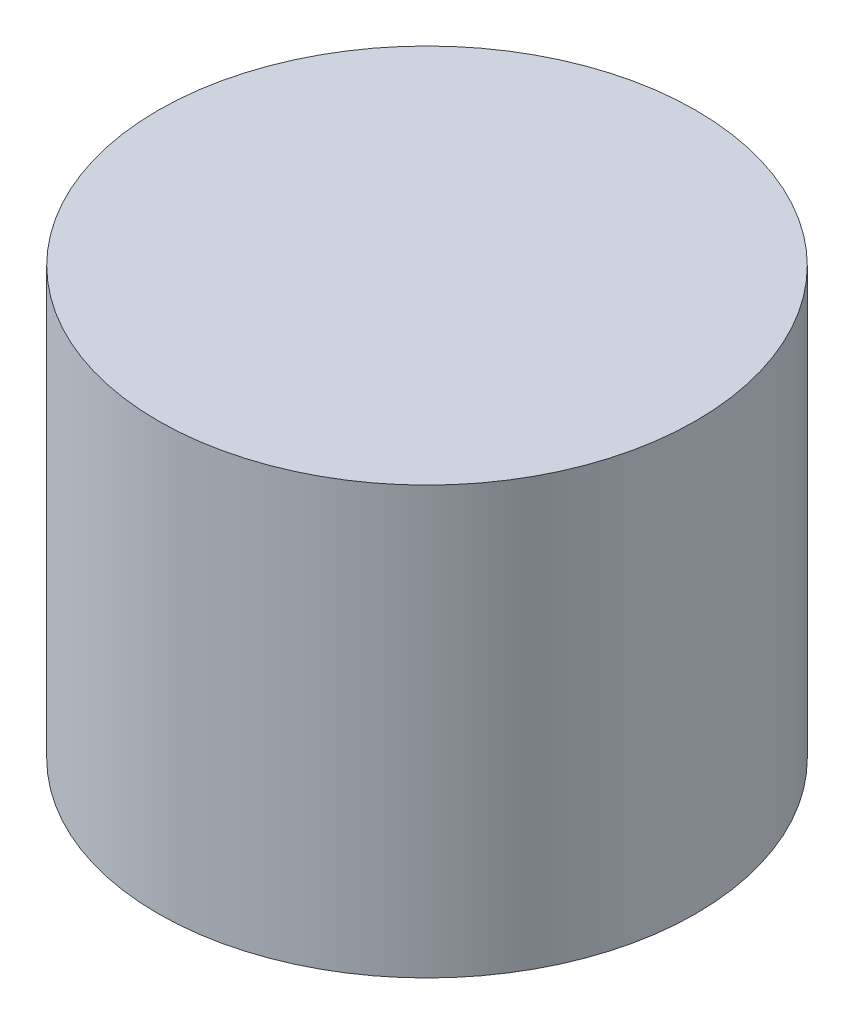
from build123d import *

# Parameters (mm, degrees)
SKIZZE8_R               = 315
LINEAR_AUSTRAGEN4_DEPTH = 250


with BuildPart() as part:
    # Skizze8 → Linear austragen4 (new, symmetric)
    with BuildSketch(Plane(origin=(0, 0, 0), x_dir=(1, 0, 0), z_dir=(0, 1, 0))):
        with Locations(Location((0, 0, 0), (0, 0, 270))):
            Circle(SKIZZE8_R)
    extrude(amount=LINEAR_AUSTRAGEN4_DEPTH, both=True)


solid = part.part
